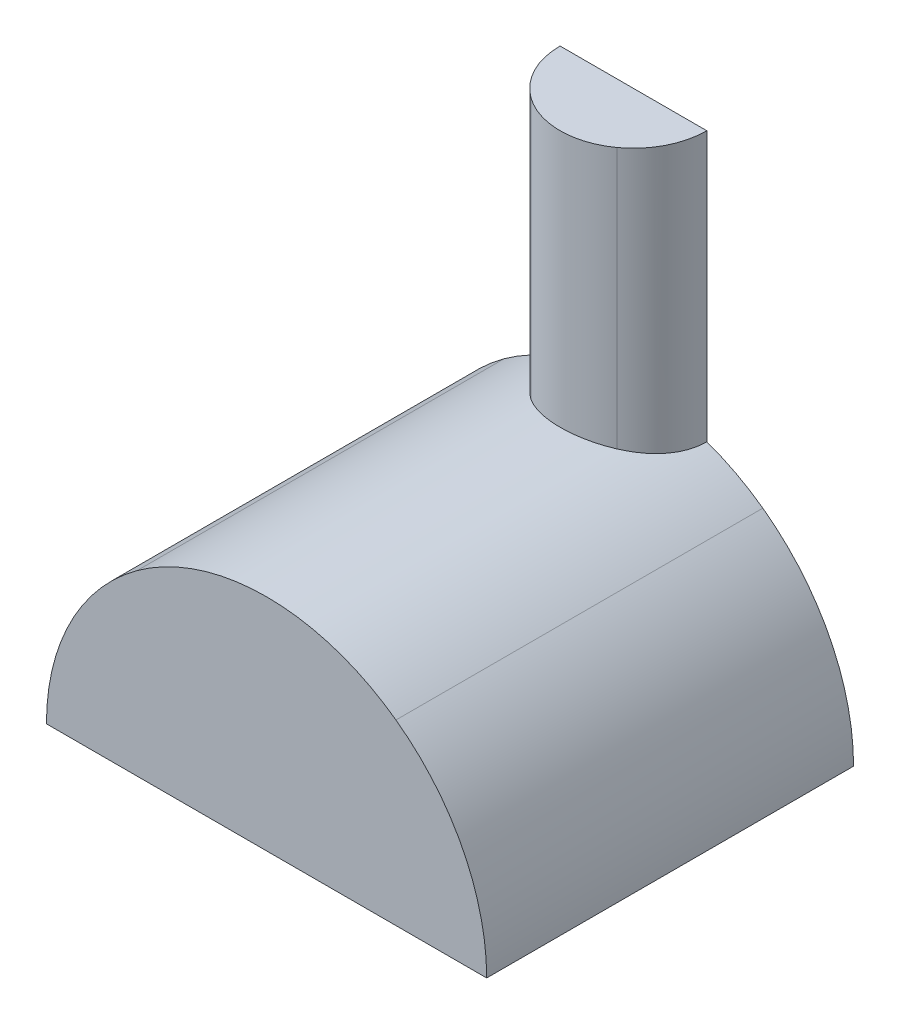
ISO-10303-21;
HEADER;
FILE_DESCRIPTION(('STEP AP214'),'2;1');
FILE_NAME('part.step','',(''),(''),'','','');
FILE_SCHEMA(('AUTOMOTIVE_DESIGN { 1 0 10303 214 1 1 1 1 }'));
ENDSEC;
DATA;
#1=APPLICATION_CONTEXT('core data for automotive mechanical design processes');
#2=APPLICATION_PROTOCOL_DEFINITION('international standard','automotive_design',2000,#1);
#3=PRODUCT_CONTEXT('',#1,'mechanical');
#4=PRODUCT('Part','Part','',(#3));
#5=PRODUCT_RELATED_PRODUCT_CATEGORY('part','',(#4));
#6=PRODUCT_DEFINITION_FORMATION('','',#4);
#7=PRODUCT_DEFINITION_CONTEXT('part definition',#1,'design');
#8=PRODUCT_DEFINITION('design','',#6,#7);
#9=PRODUCT_DEFINITION_SHAPE('','',#8);
#10=(LENGTH_UNIT() NAMED_UNIT(*) SI_UNIT(.MILLI.,.METRE.));
#11=(NAMED_UNIT(*) PLANE_ANGLE_UNIT() SI_UNIT($,.RADIAN.));
#12=(NAMED_UNIT(*) SI_UNIT($,.STERADIAN.) SOLID_ANGLE_UNIT());
#13=UNCERTAINTY_MEASURE_WITH_UNIT(LENGTH_MEASURE(1.E-05),#10,'distance_accuracy_value','');
#14=(GEOMETRIC_REPRESENTATION_CONTEXT(3) GLOBAL_UNCERTAINTY_ASSIGNED_CONTEXT((#13)) GLOBAL_UNIT_ASSIGNED_CONTEXT((#10,
#11,#12)) REPRESENTATION_CONTEXT('',''));
#15=CARTESIAN_POINT('',(0.,0.,0.));
#16=DIRECTION('',(0.,0.,1.));
#17=DIRECTION('',(1.,0.,0.));
#18=AXIS2_PLACEMENT_3D('',#15,#16,#17);
#19=CARTESIAN_POINT('',(0.,3302.,0.));
#20=DIRECTION('',(0.,-1.,0.));
#21=DIRECTION('',(0.,0.,-1.));
#22=AXIS2_PLACEMENT_3D('',#19,#20,#21);
#23=CYLINDRICAL_SURFACE('',#22,508.);
#24=CARTESIAN_POINT('',(508.,1436.84097937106,8.88178419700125E-13));
#25=CARTESIAN_POINT('',(508.000002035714,1436.84097391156,3.46484566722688));
#26=CARTESIAN_POINT('',(507.964550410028,1436.85351327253,6.92958914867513));
#27=CARTESIAN_POINT('',(507.822779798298,1436.90362674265,13.8574209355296));
#28=CARTESIAN_POINT('',(507.716461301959,1436.94120067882,17.3205092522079));
#29=CARTESIAN_POINT('',(507.291285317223,1437.09138499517,27.7046839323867));
#30=CARTESIAN_POINT('',(506.866207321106,1437.24145789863,34.6211841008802));
#31=CARTESIAN_POINT('',(505.733964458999,1437.64026003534,48.4263451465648));
#32=CARTESIAN_POINT('',(505.026874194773,1437.88896317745,55.3150128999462));
#33=CARTESIAN_POINT('',(503.756090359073,1438.33445305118,65.6184381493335));
#34=CARTESIAN_POINT('',(503.297463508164,1438.49502482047,69.048029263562));
#35=CARTESIAN_POINT('',(502.310400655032,1438.83999625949,75.8961790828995));
#36=CARTESIAN_POINT('',(501.78196008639,1439.02439748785,79.3147370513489));
#37=CARTESIAN_POINT('',(500.095799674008,1439.61161858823,89.5306504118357));
#38=CARTESIAN_POINT('',(498.83465137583,1440.04936672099,96.3092222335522));
#39=CARTESIAN_POINT('',(496.039022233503,1441.01473766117,109.803304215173));
#40=CARTESIAN_POINT('',(494.504540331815,1441.54236081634,116.518814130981));
#41=CARTESIAN_POINT('',(492.000541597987,1442.39808719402,126.535831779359));
#42=CARTESIAN_POINT('',(491.132105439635,1442.69406397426,129.865658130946));
#43=CARTESIAN_POINT('',(489.328342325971,1443.30685604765,136.504967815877));
#44=CARTESIAN_POINT('',(488.393019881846,1443.62366993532,139.814452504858));
#45=CARTESIAN_POINT('',(485.487339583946,1444.60452325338,149.710778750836));
#46=CARTESIAN_POINT('',(483.417231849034,1445.29898699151,156.265640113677));
#47=CARTESIAN_POINT('',(479.0171167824,1446.76327454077,169.27410336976));
#48=CARTESIAN_POINT('',(476.687273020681,1447.53305088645,175.727766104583));
#49=CARTESIAN_POINT('',(471.771370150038,1449.14266485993,188.527916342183));
#50=CARTESIAN_POINT('',(469.185311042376,1449.98250248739,194.874403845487));
#51=CARTESIAN_POINT('',(463.762138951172,1451.72614166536,207.450161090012));
#52=CARTESIAN_POINT('',(460.925027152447,1452.629942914,213.67943138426));
#53=CARTESIAN_POINT('',(455.005128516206,1454.49508878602,226.011312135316));
#54=CARTESIAN_POINT('',(451.922341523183,1455.45643344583,232.113922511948));
#55=CARTESIAN_POINT('',(445.514933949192,1457.43050850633,244.186756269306));
#56=CARTESIAN_POINT('',(442.190179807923,1458.44326719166,250.156904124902));
#57=CARTESIAN_POINT('',(435.306177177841,1460.51273512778,261.952599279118));
#58=CARTESIAN_POINT('',(431.746929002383,1461.56944431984,267.778146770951));
#59=CARTESIAN_POINT('',(424.399849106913,1463.71971990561,279.276415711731));
#60=CARTESIAN_POINT('',(420.612013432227,1464.81328693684,284.94913451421));
#61=CARTESIAN_POINT('',(412.813929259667,1467.03002368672,296.133646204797));
#62=CARTESIAN_POINT('',(408.803679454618,1468.15319357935,301.645438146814));
#63=CARTESIAN_POINT('',(400.421523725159,1470.46188724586,312.69211436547));
#64=CARTESIAN_POINT('',(396.041846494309,1471.64821211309,318.220936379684));
#65=CARTESIAN_POINT('',(387.057891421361,1474.03656404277,329.089499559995));
#66=CARTESIAN_POINT('',(382.453612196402,1475.23859120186,334.429239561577));
#67=CARTESIAN_POINT('',(373.027642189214,1477.65017647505,344.91167211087));
#68=CARTESIAN_POINT('',(368.205947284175,1478.85973473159,350.054360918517));
#69=CARTESIAN_POINT('',(358.352684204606,1481.27819364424,360.134737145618));
#70=CARTESIAN_POINT('',(353.32111630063,1482.48709430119,365.072424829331));
#71=CARTESIAN_POINT('',(343.054866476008,1484.89634748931,374.735989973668));
#72=CARTESIAN_POINT('',(337.820149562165,1486.09669850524,379.461830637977));
#73=CARTESIAN_POINT('',(327.156322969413,1488.48063129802,388.693291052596));
#74=CARTESIAN_POINT('',(321.727213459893,1489.66421308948,393.198910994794));
#75=CARTESIAN_POINT('',(310.682709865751,1492.00674274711,401.982633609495));
#76=CARTESIAN_POINT('',(305.067313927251,1493.16569036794,406.260734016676));
#77=CARTESIAN_POINT('',(293.658760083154,1495.45122859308,414.582179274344));
#78=CARTESIAN_POINT('',(287.865601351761,1496.57781904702,418.625523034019));
#79=CARTESIAN_POINT('',(275.956451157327,1498.82010402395,426.573108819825));
#80=CARTESIAN_POINT('',(269.835978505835,1499.93474108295,430.470937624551));
#81=CARTESIAN_POINT('',(257.427113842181,1502.11416448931,438.004526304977));
#82=CARTESIAN_POINT('',(251.138721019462,1503.17895059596,441.640284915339));
#83=CARTESIAN_POINT('',(238.404305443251,1505.25114253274,448.642605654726));
#84=CARTESIAN_POINT('',(231.95827839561,1506.25854679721,452.00916043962));
#85=CARTESIAN_POINT('',(218.919730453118,1508.20873966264,458.466001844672));
#86=CARTESIAN_POINT('',(212.327209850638,1509.15152839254,461.556289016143));
#87=CARTESIAN_POINT('',(199.008736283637,1510.96547917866,467.453258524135));
#88=CARTESIAN_POINT('',(192.282815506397,1511.83665825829,470.260008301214));
#89=CARTESIAN_POINT('',(178.708025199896,1513.50130569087,475.584480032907));
#90=CARTESIAN_POINT('',(171.859155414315,1514.29477388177,478.102201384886));
#91=CARTESIAN_POINT('',(158.051291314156,1515.79814501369,482.842696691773));
#92=CARTESIAN_POINT('',(151.092300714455,1516.50805076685,485.06548057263));
#93=CARTESIAN_POINT('',(137.077105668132,1517.83906075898,489.21086278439));
#94=CARTESIAN_POINT('',(130.020901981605,1518.46016569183,491.133463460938));
#95=CARTESIAN_POINT('',(116.071844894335,1519.58894865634,494.612155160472));
#96=CARTESIAN_POINT('',(109.181847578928,1520.0998207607,496.178669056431));
#97=CARTESIAN_POINT('',(95.3366275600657,1521.03092179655,499.023920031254));
#98=CARTESIAN_POINT('',(88.3814053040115,1521.45115134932,500.302659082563));
#99=CARTESIAN_POINT('',(74.4188262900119,1522.19798818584,502.569259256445));
#100=CARTESIAN_POINT('',(67.4114702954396,1522.52459683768,503.557124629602));
#101=CARTESIAN_POINT('',(53.3578203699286,1523.08187452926,505.2395736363));
#102=CARTESIAN_POINT('',(46.3115263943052,1523.31254345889,505.934156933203));
#103=CARTESIAN_POINT('',(32.1949771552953,1523.67625351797,507.028196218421));
#104=CARTESIAN_POINT('',(25.1247270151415,1523.80931434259,507.427711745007));
#105=CARTESIAN_POINT('',(10.9725237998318,1523.97692955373,507.930839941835));
#106=CARTESIAN_POINT('',(3.8905707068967,1524.01148379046,508.034452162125));
#107=CARTESIAN_POINT('',(-10.2711191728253,1523.98183782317,507.945512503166));
#108=CARTESIAN_POINT('',(-17.3508560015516,1523.91763961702,507.752966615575));
#109=CARTESIAN_POINT('',(-31.4944839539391,1523.69095283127,507.072206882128));
#110=CARTESIAN_POINT('',(-38.5583751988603,1523.52846500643,506.583995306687));
#111=CARTESIAN_POINT('',(-52.3796127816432,1523.11466455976,505.338116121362));
#112=CARTESIAN_POINT('',(-59.138096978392,1522.86709340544,504.591791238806));
#113=CARTESIAN_POINT('',(-72.6158972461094,1522.28395128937,502.829116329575));
#114=CARTESIAN_POINT('',(-79.3352136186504,1521.94838100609,501.812768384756));
#115=CARTESIAN_POINT('',(-92.7227594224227,1521.19145375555,499.512380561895));
#116=CARTESIAN_POINT('',(-99.390990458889,1520.77009949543,498.228349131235));
#117=CARTESIAN_POINT('',(-112.66513326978,1519.84434505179,495.395422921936));
#118=CARTESIAN_POINT('',(-119.271044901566,1519.33994467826,493.846527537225));
#119=CARTESIAN_POINT('',(-132.409505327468,1518.25135446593,490.487206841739));
#120=CARTESIAN_POINT('',(-138.942052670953,1517.66716305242,488.676776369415));
#121=CARTESIAN_POINT('',(-151.922838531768,1516.42275240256,484.798243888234));
#122=CARTESIAN_POINT('',(-158.371077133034,1515.7625332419,482.730142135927));
#123=CARTESIAN_POINT('',(-171.172928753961,1514.37026057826,478.340483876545));
#124=CARTESIAN_POINT('',(-177.526540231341,1513.63820590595,476.018923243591));
#125=CARTESIAN_POINT('',(-190.12900579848,1512.10689232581,471.126999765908));
#126=CARTESIAN_POINT('',(-196.377859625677,1511.30763324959,468.556636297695));
#127=CARTESIAN_POINT('',(-208.842405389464,1509.63601791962,463.136738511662));
#128=CARTESIAN_POINT('',(-215.056587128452,1508.7628403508,460.283984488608));
#129=CARTESIAN_POINT('',(-227.357947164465,1506.95819778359,454.3336295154));
#130=CARTESIAN_POINT('',(-233.445125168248,1506.02673265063,451.23602799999));
#131=CARTESIAN_POINT('',(-245.483281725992,1504.11140057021,444.801683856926));
#132=CARTESIAN_POINT('',(-251.434260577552,1503.12753373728,441.464941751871));
#133=CARTESIAN_POINT('',(-263.191255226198,1501.11356485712,434.558219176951));
#134=CARTESIAN_POINT('',(-268.997271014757,1500.08346280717,430.988238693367));
#135=CARTESIAN_POINT('',(-280.457198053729,1497.98321197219,423.620318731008));
#136=CARTESIAN_POINT('',(-286.111075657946,1496.91305445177,419.82232941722));
#137=CARTESIAN_POINT('',(-297.257335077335,1494.73954860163,412.005355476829));
#138=CARTESIAN_POINT('',(-302.749717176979,1493.63620033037,407.986371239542));
#139=CARTESIAN_POINT('',(-313.565394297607,1491.40310985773,399.733681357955));
#140=CARTESIAN_POINT('',(-318.888685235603,1490.27336702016,395.499970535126));
#141=CARTESIAN_POINT('',(-329.358612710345,1487.99449210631,386.824412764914));
#142=CARTESIAN_POINT('',(-334.505247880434,1486.84535988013,382.382564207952));
#143=CARTESIAN_POINT('',(-344.85245483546,1484.48046729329,373.083658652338));
#144=CARTESIAN_POINT('',(-350.044176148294,1483.26411544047,368.216898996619));
#145=CARTESIAN_POINT('',(-360.218050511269,1480.82622889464,358.270244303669));
#146=CARTESIAN_POINT('',(-365.200201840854,1479.60469415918,353.19034751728));
#147=CARTESIAN_POINT('',(-374.947311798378,1477.16476896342,342.825211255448));
#148=CARTESIAN_POINT('',(-379.712262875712,1475.94637861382,337.539964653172));
#149=CARTESIAN_POINT('',(-389.017204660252,1473.52120143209,326.77246616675));
#150=CARTESIAN_POINT('',(-393.557195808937,1472.31441457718,321.290214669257));
#151=CARTESIAN_POINT('',(-402.406347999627,1469.92045655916,310.135186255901));
#152=CARTESIAN_POINT('',(-406.715429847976,1468.73329222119,304.462345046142));
#153=CARTESIAN_POINT('',(-415.093863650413,1466.38740122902,292.936587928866));
#154=CARTESIAN_POINT('',(-419.163215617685,1465.22867457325,287.083672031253));
#155=CARTESIAN_POINT('',(-427.055027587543,1462.94800808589,275.206897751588));
#156=CARTESIAN_POINT('',(-430.877493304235,1461.82606740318,269.183043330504));
#157=CARTESIAN_POINT('',(-438.268733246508,1459.62713894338,256.973622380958));
#158=CARTESIAN_POINT('',(-441.837506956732,1458.55015125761,250.788055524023));
#159=CARTESIAN_POINT('',(-448.765545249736,1456.43358905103,238.172284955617));
#160=CARTESIAN_POINT('',(-452.120926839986,1455.39480427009,231.73981539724));
#161=CARTESIAN_POINT('',(-458.556715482,1453.37989167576,218.729086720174));
#162=CARTESIAN_POINT('',(-461.637121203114,1452.40376416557,212.150826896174));
#163=CARTESIAN_POINT('',(-467.516787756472,1450.5218314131,198.85892173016));
#164=CARTESIAN_POINT('',(-470.316012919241,1449.61603509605,192.14525934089));
#165=CARTESIAN_POINT('',(-475.626643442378,1447.88228084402,178.595203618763));
#166=CARTESIAN_POINT('',(-478.138051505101,1447.05432217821,171.75881143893));
#167=CARTESIAN_POINT('',(-482.864038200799,1445.48417948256,157.985003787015));
#168=CARTESIAN_POINT('',(-485.079017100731,1444.74187997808,151.047738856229));
#169=CARTESIAN_POINT('',(-489.210915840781,1443.34799510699,137.075718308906));
#170=CARTESIAN_POINT('',(-491.127826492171,1442.69641253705,130.040959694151));
#171=CARTESIAN_POINT('',(-494.657989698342,1441.48983744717,115.890584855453));
#172=CARTESIAN_POINT('',(-496.271365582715,1440.9348057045,108.775002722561));
#173=CARTESIAN_POINT('',(-499.1911454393,1439.92589713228,94.4745708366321));
#174=CARTESIAN_POINT('',(-500.497585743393,1439.47200833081,87.2897293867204));
#175=CARTESIAN_POINT('',(-502.176905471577,1438.8866056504,76.7696651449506));
#176=CARTESIAN_POINT('',(-502.672324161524,1438.7135832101,73.4558660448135));
#177=CARTESIAN_POINT('',(-503.597612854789,1438.38996269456,66.8182009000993));
#178=CARTESIAN_POINT('',(-504.027486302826,1438.23936344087,63.4943353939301));
#179=CARTESIAN_POINT('',(-505.218232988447,1437.82170368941,53.5112052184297));
#180=CARTESIAN_POINT('',(-505.880539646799,1437.58867391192,46.838483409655));
#181=CARTESIAN_POINT('',(-506.939900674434,1437.21545083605,33.4781135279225));
#182=CARTESIAN_POINT('',(-507.33729719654,1437.07513778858,26.790495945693));
#183=CARTESIAN_POINT('',(-507.734846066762,1436.93470378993,16.7497070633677));
#184=CARTESIAN_POINT('',(-507.834271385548,1436.89956503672,13.4006807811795));
#185=CARTESIAN_POINT('',(-507.966849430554,1436.85270037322,6.70113378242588));
#186=CARTESIAN_POINT('',(-508.000001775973,1436.84097459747,3.35061305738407));
#187=CARTESIAN_POINT('',(-508.,1436.84097937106,8.79191076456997E-13));
#188=B_SPLINE_CURVE_WITH_KNOTS('',3,(#24,#25,#26,#27,#28,#29,#30,#31,#32,#33,#34,#35,#36,#37,
#38,#39,#40,#41,#42,#43,#44,#45,#46,#47,#48,#49,#50,#51,#52,#53,#54,#55,#56,#57,#58,#59,#60,#61,
#62,#63,#64,#65,#66,#67,#68,#69,#70,#71,#72,#73,#74,#75,#76,#77,#78,#79,#80,#81,#82,#83,#84,#85,
#86,#87,#88,#89,#90,#91,#92,#93,#94,#95,#96,#97,#98,#99,#100,#101,#102,#103,#104,#105,#106,#107,
#108,#109,#110,#111,#112,#113,#114,#115,#116,#117,#118,#119,#120,#121,#122,#123,#124,#125,#126,
#127,#128,#129,#130,#131,#132,#133,#134,#135,#136,#137,#138,#139,#140,#141,#142,#143,#144,#145,
#146,#147,#148,#149,#150,#151,#152,#153,#154,#155,#156,#157,#158,#159,#160,#161,#162,#163,#164,
#165,#166,#167,#168,#169,#170,#171,#172,#173,#174,#175,#176,#177,#178,#179,#180,#181,#182,#183,
#184,#185,#186,#187),.UNSPECIFIED.,.F.,.F.,(4,2,2,2,2,2,2,2,2,2,2,2,2,2,2,2,2,2,2,2,2,2,2,2,2,2,
2,2,2,2,2,2,2,2,2,2,2,2,2,2,2,2,2,2,2,2,2,2,2,2,2,2,2,2,2,2,2,2,2,2,2,2,2,2,2,2,2,2,2,2,2,2,2,2,
2,2,2,2,2,2,2,4),(0.,10.3941289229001,20.7881860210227,41.5747892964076,62.3558974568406,
72.7467280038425,83.1382385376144,103.85784573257,124.577533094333,134.938600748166,
145.298970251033,166.019251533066,186.72655705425,207.433862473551,228.141070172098,
248.848290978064,269.56702967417,290.285740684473,311.004810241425,331.724001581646,
353.175102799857,374.626336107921,396.07797636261,417.52958896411,438.984913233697,
460.440218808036,481.895737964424,503.351356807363,525.368699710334,547.386148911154,
569.404198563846,591.422204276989,613.434960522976,635.447762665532,657.45982379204,
679.471712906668,700.717901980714,721.963945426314,743.209678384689,764.455435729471,
785.696904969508,806.938406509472,828.179478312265,849.420387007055,869.826592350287,
890.232640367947,910.63804452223,931.043495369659,951.449348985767,971.855182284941,
992.261347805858,1012.66756446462,1033.34145591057,1054.01539508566,1074.68928908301,
1095.36318429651,1116.04161469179,1136.72000866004,1157.39890156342,1178.07795440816,
1199.72971980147,1221.38166291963,1243.03435815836,1264.68701090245,1286.34704282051,
1308.0070735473,1329.6666027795,1351.32617601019,1373.30634894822,1395.28662824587,
1417.26969236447,1439.25255006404,1461.20541828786,1483.15896313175,1505.10356864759,
1527.04557527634,1537.11024612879,1547.1743878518,1567.29682360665,1587.39321899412,
1597.44463151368,1607.49610178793),.UNSPECIFIED.);
#189=CARTESIAN_POINT('',(-298.594908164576,1494.46213763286,410.980633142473));
#190=VERTEX_POINT('',#189);
#191=CARTESIAN_POINT('',(-508.,1436.84097937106,0.));
#192=VERTEX_POINT('',#191);
#193=EDGE_CURVE('E125',#190,#192,#188,.T.);
#194=ORIENTED_EDGE('',*,*,#193,.F.);
#195=DIRECTION('',(0.,1.,0.));
#196=VECTOR('',#195,1.);
#197=CARTESIAN_POINT('',(-298.594908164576,3302.,410.980633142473));
#198=LINE('',#197,#196);
#199=CARTESIAN_POINT('',(-298.594908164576,3302.,410.980633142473));
#200=VERTEX_POINT('',#199);
#201=EDGE_CURVE('E12',#190,#200,#198,.T.);
#202=ORIENTED_EDGE('',*,*,#201,.T.);
#203=CARTESIAN_POINT('',(0.,3302.,0.));
#204=DIRECTION('',(0.,-1.,0.));
#205=DIRECTION('',(0.,0.,-1.));
#206=AXIS2_PLACEMENT_3D('',#203,#204,#205);
#207=CIRCLE('',#206,508.);
#208=CARTESIAN_POINT('',(-508.,3302.,0.));
#209=VERTEX_POINT('',#208);
#210=EDGE_CURVE('E99',#200,#209,#207,.T.);
#211=ORIENTED_EDGE('',*,*,#210,.T.);
#212=DIRECTION('',(0.,-1.,0.));
#213=VECTOR('',#212,1.);
#214=CARTESIAN_POINT('',(-508.,3302.,0.));
#215=LINE('',#214,#213);
#216=EDGE_CURVE('E101',#209,#192,#215,.T.);
#217=ORIENTED_EDGE('',*,*,#216,.T.);
#218=EDGE_LOOP('',(#194,#202,#211,#217));
#219=FACE_BOUND('',#218,.T.);
#220=ADVANCED_FACE('F38',(#219),#23,.T.);
#221=ORIENTED_EDGE('',*,*,#201,.F.);
#222=CARTESIAN_POINT('',(298.594908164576,1494.46213763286,410.980633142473));
#223=VERTEX_POINT('',#222);
#224=EDGE_CURVE('E135',#223,#190,#188,.T.);
#225=ORIENTED_EDGE('',*,*,#224,.F.);
#226=DIRECTION('',(0.,1.,0.));
#227=VECTOR('',#226,1.);
#228=CARTESIAN_POINT('',(298.594908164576,3302.,410.980633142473));
#229=LINE('',#228,#227);
#230=CARTESIAN_POINT('',(298.594908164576,3302.,410.980633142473));
#231=VERTEX_POINT('',#230);
#232=EDGE_CURVE('E47',#223,#231,#229,.T.);
#233=ORIENTED_EDGE('',*,*,#232,.T.);
#234=EDGE_CURVE('E105',#231,#200,#207,.T.);
#235=ORIENTED_EDGE('',*,*,#234,.T.);
#236=EDGE_LOOP('',(#221,#225,#233,#235));
#237=FACE_BOUND('',#236,.T.);
#238=ADVANCED_FACE('F144',(#237),#23,.T.);
#239=CARTESIAN_POINT('',(0.,0.,2540.));
#240=DIRECTION('',(0.,0.,-1.));
#241=DIRECTION('',(-1.,0.,0.));
#242=AXIS2_PLACEMENT_3D('',#239,#240,#241);
#243=CYLINDRICAL_SURFACE('',#242,1524.);
#244=CARTESIAN_POINT('',(0.,0.,0.));
#245=DIRECTION('',(0.,0.,1.));
#246=DIRECTION('',(1.,0.,0.));
#247=AXIS2_PLACEMENT_3D('',#244,#245,#246);
#248=CIRCLE('',#247,1524.);
#249=CARTESIAN_POINT('',(-895.784724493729,1232.94189942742,0.));
#250=VERTEX_POINT('',#249);
#251=EDGE_CURVE('E117',#192,#250,#248,.T.);
#252=ORIENTED_EDGE('',*,*,#251,.T.);
#253=DIRECTION('',(0.,0.,1.));
#254=VECTOR('',#253,1.);
#255=CARTESIAN_POINT('',(-895.784724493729,1232.94189942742,2540.));
#256=LINE('',#255,#254);
#257=CARTESIAN_POINT('',(-895.784724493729,1232.94189942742,2540.));
#258=VERTEX_POINT('',#257);
#259=EDGE_CURVE('E172',#250,#258,#256,.T.);
#260=ORIENTED_EDGE('',*,*,#259,.T.);
#261=CARTESIAN_POINT('',(0.,0.,2540.));
#262=DIRECTION('',(0.,0.,1.));
#263=DIRECTION('',(1.,0.,0.));
#264=AXIS2_PLACEMENT_3D('',#261,#262,#263);
#265=CIRCLE('',#264,1524.);
#266=CARTESIAN_POINT('',(895.784724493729,1232.94189942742,2540.));
#267=VERTEX_POINT('',#266);
#268=EDGE_CURVE('E186',#267,#258,#265,.T.);
#269=ORIENTED_EDGE('',*,*,#268,.F.);
#270=DIRECTION('',(0.,0.,1.));
#271=VECTOR('',#270,1.);
#272=CARTESIAN_POINT('',(895.784724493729,1232.94189942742,2540.));
#273=LINE('',#272,#271);
#274=CARTESIAN_POINT('',(895.784724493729,1232.94189942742,0.));
#275=VERTEX_POINT('',#274);
#276=EDGE_CURVE('E193',#275,#267,#273,.T.);
#277=ORIENTED_EDGE('',*,*,#276,.F.);
#278=CARTESIAN_POINT('',(508.,1436.84097937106,0.));
#279=VERTEX_POINT('',#278);
#280=EDGE_CURVE('E175',#275,#279,#248,.T.);
#281=ORIENTED_EDGE('',*,*,#280,.T.);
#282=EDGE_CURVE('E127',#279,#223,#188,.T.);
#283=ORIENTED_EDGE('',*,*,#282,.T.);
#284=ORIENTED_EDGE('',*,*,#224,.T.);
#285=ORIENTED_EDGE('',*,*,#193,.T.);
#286=EDGE_LOOP('',(#252,#260,#269,#277,#281,#283,#284,#285));
#287=FACE_BOUND('',#286,.T.);
#288=ADVANCED_FACE('F158',(#287),#243,.T.);
#289=CARTESIAN_POINT('',(1524.,0.,0.));
#290=VERTEX_POINT('',#289);
#291=EDGE_CURVE('E177',#290,#275,#248,.T.);
#292=ORIENTED_EDGE('',*,*,#291,.T.);
#293=ORIENTED_EDGE('',*,*,#276,.T.);
#294=CARTESIAN_POINT('',(1524.,0.,2540.));
#295=VERTEX_POINT('',#294);
#296=EDGE_CURVE('E136',#295,#267,#265,.T.);
#297=ORIENTED_EDGE('',*,*,#296,.F.);
#298=DIRECTION('',(0.,0.,-1.));
#299=VECTOR('',#298,1.);
#300=CARTESIAN_POINT('',(1524.,0.,2540.));
#301=LINE('',#300,#299);
#302=EDGE_CURVE('E188',#295,#290,#301,.T.);
#303=ORIENTED_EDGE('',*,*,#302,.T.);
#304=EDGE_LOOP('',(#292,#293,#297,#303));
#305=FACE_BOUND('',#304,.T.);
#306=ADVANCED_FACE('F156',(#305),#243,.T.);
#307=ORIENTED_EDGE('',*,*,#259,.F.);
#308=CARTESIAN_POINT('',(-1524.,0.,0.));
#309=VERTEX_POINT('',#308);
#310=EDGE_CURVE('E134',#250,#309,#248,.T.);
#311=ORIENTED_EDGE('',*,*,#310,.T.);
#312=DIRECTION('',(0.,0.,-1.));
#313=VECTOR('',#312,1.);
#314=CARTESIAN_POINT('',(-1524.,0.,2540.));
#315=LINE('',#314,#313);
#316=CARTESIAN_POINT('',(-1524.,0.,2540.));
#317=VERTEX_POINT('',#316);
#318=EDGE_CURVE('E190',#317,#309,#315,.T.);
#319=ORIENTED_EDGE('',*,*,#318,.F.);
#320=EDGE_CURVE('E182',#258,#317,#265,.T.);
#321=ORIENTED_EDGE('',*,*,#320,.F.);
#322=EDGE_LOOP('',(#307,#311,#319,#321));
#323=FACE_BOUND('',#322,.T.);
#324=ADVANCED_FACE('F40',(#323),#243,.T.);
#325=CARTESIAN_POINT('',(-1524.,0.,2540.));
#326=DIRECTION('',(0.,1.,0.));
#327=DIRECTION('',(0.,0.,1.));
#328=AXIS2_PLACEMENT_3D('',#325,#326,#327);
#329=PLANE('',#328);
#330=DIRECTION('',(1.,0.,0.));
#331=VECTOR('',#330,1.);
#332=CARTESIAN_POINT('',(-1524.,0.,0.));
#333=LINE('',#332,#331);
#334=EDGE_CURVE('E180',#309,#290,#333,.T.);
#335=ORIENTED_EDGE('',*,*,#334,.T.);
#336=ORIENTED_EDGE('',*,*,#302,.F.);
#337=DIRECTION('',(1.,0.,0.));
#338=VECTOR('',#337,1.);
#339=CARTESIAN_POINT('',(-1524.,0.,2540.));
#340=LINE('',#339,#338);
#341=EDGE_CURVE('E191',#317,#295,#340,.T.);
#342=ORIENTED_EDGE('',*,*,#341,.F.);
#343=ORIENTED_EDGE('',*,*,#318,.T.);
#344=EDGE_LOOP('',(#335,#336,#342,#343));
#345=FACE_BOUND('',#344,.T.);
#346=ADVANCED_FACE('F148',(#345),#329,.F.);
#347=CARTESIAN_POINT('',(0.,0.,2540.));
#348=DIRECTION('',(0.,0.,1.));
#349=DIRECTION('',(1.,0.,0.));
#350=AXIS2_PLACEMENT_3D('',#347,#348,#349);
#351=PLANE('',#350);
#352=ORIENTED_EDGE('',*,*,#296,.T.);
#353=ORIENTED_EDGE('',*,*,#268,.T.);
#354=ORIENTED_EDGE('',*,*,#320,.T.);
#355=ORIENTED_EDGE('',*,*,#341,.T.);
#356=EDGE_LOOP('',(#352,#353,#354,#355));
#357=FACE_BOUND('',#356,.T.);
#358=ADVANCED_FACE('F145',(#357),#351,.T.);
#359=CARTESIAN_POINT('',(0.,0.,0.));
#360=DIRECTION('',(0.,0.,1.));
#361=DIRECTION('',(1.,0.,0.));
#362=AXIS2_PLACEMENT_3D('',#359,#360,#361);
#363=PLANE('',#362);
#364=ORIENTED_EDGE('',*,*,#291,.F.);
#365=ORIENTED_EDGE('',*,*,#334,.F.);
#366=ORIENTED_EDGE('',*,*,#310,.F.);
#367=ORIENTED_EDGE('',*,*,#251,.F.);
#368=ORIENTED_EDGE('',*,*,#216,.F.);
#369=DIRECTION('',(1.,0.,0.));
#370=VECTOR('',#369,1.);
#371=CARTESIAN_POINT('',(508.,3302.,0.));
#372=LINE('',#371,#370);
#373=CARTESIAN_POINT('',(508.,3302.,0.));
#374=VERTEX_POINT('',#373);
#375=EDGE_CURVE('E114',#209,#374,#372,.T.);
#376=ORIENTED_EDGE('',*,*,#375,.T.);
#377=DIRECTION('',(0.,-1.,0.));
#378=VECTOR('',#377,1.);
#379=CARTESIAN_POINT('',(508.,3302.,0.));
#380=LINE('',#379,#378);
#381=EDGE_CURVE('E118',#374,#279,#380,.T.);
#382=ORIENTED_EDGE('',*,*,#381,.T.);
#383=ORIENTED_EDGE('',*,*,#280,.F.);
#384=EDGE_LOOP('',(#364,#365,#366,#367,#368,#376,#382,#383));
#385=FACE_BOUND('',#384,.T.);
#386=ADVANCED_FACE('F112',(#385),#363,.F.);
#387=ORIENTED_EDGE('',*,*,#232,.F.);
#388=ORIENTED_EDGE('',*,*,#282,.F.);
#389=ORIENTED_EDGE('',*,*,#381,.F.);
#390=EDGE_CURVE('E107',#374,#231,#207,.T.);
#391=ORIENTED_EDGE('',*,*,#390,.T.);
#392=EDGE_LOOP('',(#387,#388,#389,#391));
#393=FACE_BOUND('',#392,.T.);
#394=ADVANCED_FACE('F138',(#393),#23,.T.);
#395=CARTESIAN_POINT('',(0.,3302.,0.));
#396=DIRECTION('',(0.,-1.,0.));
#397=DIRECTION('',(0.,0.,-1.));
#398=AXIS2_PLACEMENT_3D('',#395,#396,#397);
#399=PLANE('',#398);
#400=ORIENTED_EDGE('',*,*,#390,.F.);
#401=ORIENTED_EDGE('',*,*,#375,.F.);
#402=ORIENTED_EDGE('',*,*,#210,.F.);
#403=ORIENTED_EDGE('',*,*,#234,.F.);
#404=EDGE_LOOP('',(#400,#401,#402,#403));
#405=FACE_BOUND('',#404,.T.);
#406=ADVANCED_FACE('F121',(#405),#399,.F.);
#407=CLOSED_SHELL('',(#220,#238,#288,#306,#324,#346,#358,#386,#394,#406));
#408=MANIFOLD_SOLID_BREP('B2',#407);
#409=ADVANCED_BREP_SHAPE_REPRESENTATION('',(#18,#408),#14);
#410=SHAPE_DEFINITION_REPRESENTATION(#9,#409);
ENDSEC;
END-ISO-10303-21;
